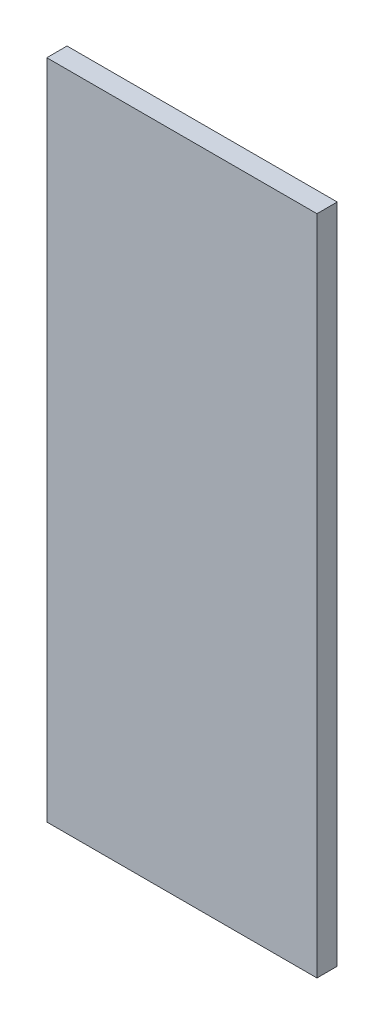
from build123d import *

# Parameters (mm, degrees)
ESQUISSE1_W        = 40
ESQUISSE1_H        = 98
BOSS_EXTRU_1_DEPTH = 3


with BuildPart() as part:
    # Esquisse1 → Boss.-Extru.1 (new body)
    with BuildSketch(Plane.XY):
        with Locations((20, 49)):
            Rectangle(ESQUISSE1_W, ESQUISSE1_H)
    extrude(amount=BOSS_EXTRU_1_DEPTH)


solid = part.part
